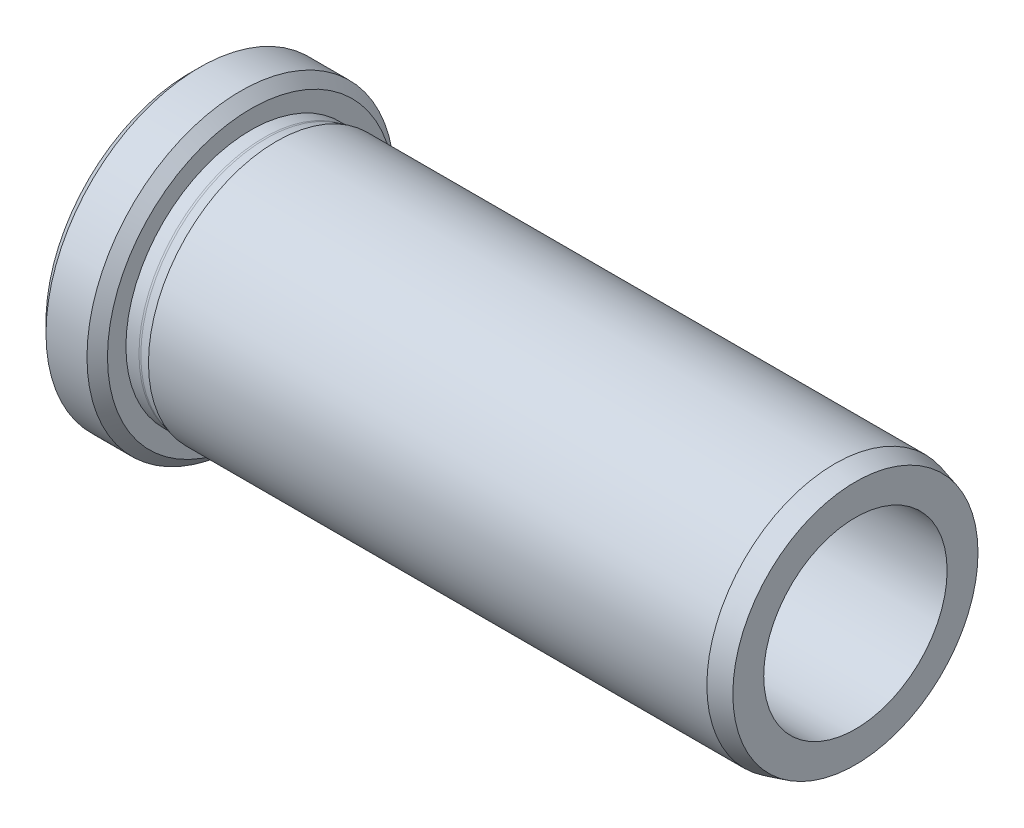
ISO-10303-21;
HEADER;
FILE_DESCRIPTION(('STEP AP214'),'2;1');
FILE_NAME('part.step','',(''),(''),'','','');
FILE_SCHEMA(('AUTOMOTIVE_DESIGN { 1 0 10303 214 1 1 1 1 }'));
ENDSEC;
DATA;
#1=APPLICATION_CONTEXT('core data for automotive mechanical design processes');
#2=APPLICATION_PROTOCOL_DEFINITION('international standard','automotive_design',2000,#1);
#3=PRODUCT_CONTEXT('',#1,'mechanical');
#4=PRODUCT('Part','Part','',(#3));
#5=PRODUCT_RELATED_PRODUCT_CATEGORY('part','',(#4));
#6=PRODUCT_DEFINITION_FORMATION('','',#4);
#7=PRODUCT_DEFINITION_CONTEXT('part definition',#1,'design');
#8=PRODUCT_DEFINITION('design','',#6,#7);
#9=PRODUCT_DEFINITION_SHAPE('','',#8);
#10=(LENGTH_UNIT() NAMED_UNIT(*) SI_UNIT(.MILLI.,.METRE.));
#11=(NAMED_UNIT(*) PLANE_ANGLE_UNIT() SI_UNIT($,.RADIAN.));
#12=(NAMED_UNIT(*) SI_UNIT($,.STERADIAN.) SOLID_ANGLE_UNIT());
#13=UNCERTAINTY_MEASURE_WITH_UNIT(LENGTH_MEASURE(1.E-05),#10,'distance_accuracy_value','');
#14=(GEOMETRIC_REPRESENTATION_CONTEXT(3) GLOBAL_UNCERTAINTY_ASSIGNED_CONTEXT((#13)) GLOBAL_UNIT_ASSIGNED_CONTEXT((#10,
#11,#12)) REPRESENTATION_CONTEXT('',''));
#15=CARTESIAN_POINT('',(0.,0.,0.));
#16=DIRECTION('',(0.,0.,1.));
#17=DIRECTION('',(1.,0.,0.));
#18=AXIS2_PLACEMENT_3D('',#15,#16,#17);
#19=CARTESIAN_POINT('',(30.8004766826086,8.95,0.));
#20=DIRECTION('',(1.,0.,0.));
#21=DIRECTION('',(0.,0.,-1.));
#22=AXIS2_PLACEMENT_3D('',#19,#20,#21);
#23=PLANE('',#22);
#24=CARTESIAN_POINT('',(30.8004766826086,0.,0.));
#25=DIRECTION('',(-1.,0.,0.));
#26=DIRECTION('',(0.,0.,1.));
#27=AXIS2_PLACEMENT_3D('',#24,#25,#26);
#28=CIRCLE('',#27,8.95);
#29=CARTESIAN_POINT('',(30.8004766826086,0.,8.95));
#30=VERTEX_POINT('',#29);
#31=EDGE_CURVE('E64',#30,#30,#28,.T.);
#32=ORIENTED_EDGE('',*,*,#31,.F.);
#33=EDGE_LOOP('',(#32));
#34=FACE_BOUND('',#33,.T.);
#35=CARTESIAN_POINT('',(30.8004766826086,0.,0.));
#36=DIRECTION('',(-1.,0.,0.));
#37=DIRECTION('',(0.,0.,1.));
#38=AXIS2_PLACEMENT_3D('',#35,#36,#37);
#39=CIRCLE('',#38,9.);
#40=CARTESIAN_POINT('',(30.8004766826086,0.,9.));
#41=VERTEX_POINT('',#40);
#42=EDGE_CURVE('E40',#41,#41,#39,.T.);
#43=ORIENTED_EDGE('',*,*,#42,.T.);
#44=EDGE_LOOP('',(#43));
#45=FACE_BOUND('',#44,.T.);
#46=ADVANCED_FACE('F14',(#34,#45),#23,.F.);
#47=CARTESIAN_POINT('',(0.,0.,0.));
#48=DIRECTION('',(-1.,0.,0.));
#49=DIRECTION('',(0.,0.,1.));
#50=AXIS2_PLACEMENT_3D('',#47,#48,#49);
#51=CYLINDRICAL_SURFACE('',#50,9.);
#52=CARTESIAN_POINT('',(12.3004766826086,0.,0.));
#53=DIRECTION('',(1.,0.,0.));
#54=DIRECTION('',(0.,0.,-1.));
#55=AXIS2_PLACEMENT_3D('',#52,#53,#54);
#56=CIRCLE('',#55,9.);
#57=CARTESIAN_POINT('',(12.3004766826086,0.,-9.));
#58=VERTEX_POINT('',#57);
#59=EDGE_CURVE('E29',#58,#58,#56,.F.);
#60=ORIENTED_EDGE('',*,*,#59,.T.);
#61=EDGE_LOOP('',(#60));
#62=FACE_BOUND('',#61,.T.);
#63=ORIENTED_EDGE('',*,*,#42,.F.);
#64=EDGE_LOOP('',(#63));
#65=FACE_BOUND('',#64,.T.);
#66=ADVANCED_FACE('F72',(#62,#65),#51,.F.);
#67=CARTESIAN_POINT('',(10.8004766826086,15.,0.));
#68=DIRECTION('',(1.,0.,0.));
#69=DIRECTION('',(0.,0.,-1.));
#70=AXIS2_PLACEMENT_3D('',#67,#68,#69);
#71=PLANE('',#70);
#72=CARTESIAN_POINT('',(10.8004766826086,0.,0.));
#73=DIRECTION('',(1.,0.,0.));
#74=DIRECTION('',(0.,0.,-1.));
#75=AXIS2_PLACEMENT_3D('',#72,#73,#74);
#76=CIRCLE('',#75,10.5);
#77=CARTESIAN_POINT('',(10.8004766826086,0.,-10.5));
#78=VERTEX_POINT('',#77);
#79=EDGE_CURVE('E25',#78,#78,#76,.T.);
#80=ORIENTED_EDGE('',*,*,#79,.T.);
#81=EDGE_LOOP('',(#80));
#82=FACE_BOUND('',#81,.T.);
#83=CARTESIAN_POINT('',(10.8004766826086,0.,0.));
#84=DIRECTION('',(1.,0.,0.));
#85=DIRECTION('',(0.,0.,-1.));
#86=AXIS2_PLACEMENT_3D('',#83,#84,#85);
#87=CIRCLE('',#86,14.);
#88=CARTESIAN_POINT('',(10.8004766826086,0.,-14.));
#89=VERTEX_POINT('',#88);
#90=EDGE_CURVE('E37',#89,#89,#87,.F.);
#91=ORIENTED_EDGE('',*,*,#90,.T.);
#92=EDGE_LOOP('',(#91));
#93=FACE_BOUND('',#92,.T.);
#94=ADVANCED_FACE('F77',(#82,#93),#71,.F.);
#95=CARTESIAN_POINT('',(0.,0.,0.));
#96=DIRECTION('',(-1.,0.,0.));
#97=DIRECTION('',(0.,0.,1.));
#98=AXIS2_PLACEMENT_3D('',#95,#96,#97);
#99=CYLINDRICAL_SURFACE('',#98,15.);
#100=CARTESIAN_POINT('',(15.8004766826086,0.,0.));
#101=DIRECTION('',(-1.,0.,0.));
#102=DIRECTION('',(0.,0.,1.));
#103=AXIS2_PLACEMENT_3D('',#100,#101,#102);
#104=CIRCLE('',#103,15.);
#105=CARTESIAN_POINT('',(15.8004766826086,0.,15.));
#106=VERTEX_POINT('',#105);
#107=EDGE_CURVE('E21',#106,#106,#104,.T.);
#108=ORIENTED_EDGE('',*,*,#107,.T.);
#109=EDGE_LOOP('',(#108));
#110=FACE_BOUND('',#109,.T.);
#111=CARTESIAN_POINT('',(11.8004766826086,0.,0.));
#112=DIRECTION('',(1.,0.,0.));
#113=DIRECTION('',(0.,0.,-1.));
#114=AXIS2_PLACEMENT_3D('',#111,#112,#113);
#115=CIRCLE('',#114,15.);
#116=CARTESIAN_POINT('',(11.8004766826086,0.,-15.));
#117=VERTEX_POINT('',#116);
#118=EDGE_CURVE('E34',#117,#117,#115,.T.);
#119=ORIENTED_EDGE('',*,*,#118,.T.);
#120=EDGE_LOOP('',(#119));
#121=FACE_BOUND('',#120,.T.);
#122=ADVANCED_FACE('F85',(#110,#121),#99,.T.);
#123=CARTESIAN_POINT('',(16.8004766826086,15.,0.));
#124=DIRECTION('',(-1.,0.,0.));
#125=DIRECTION('',(0.,0.,1.));
#126=AXIS2_PLACEMENT_3D('',#123,#124,#125);
#127=PLANE('',#126);
#128=CARTESIAN_POINT('',(16.8004766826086,0.,0.));
#129=DIRECTION('',(-1.,0.,0.));
#130=DIRECTION('',(0.,0.,1.));
#131=AXIS2_PLACEMENT_3D('',#128,#129,#130);
#132=CIRCLE('',#131,14.);
#133=CARTESIAN_POINT('',(16.8004766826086,0.,14.));
#134=VERTEX_POINT('',#133);
#135=EDGE_CURVE('E9',#134,#134,#132,.F.);
#136=ORIENTED_EDGE('',*,*,#135,.T.);
#137=EDGE_LOOP('',(#136));
#138=FACE_BOUND('',#137,.T.);
#139=CARTESIAN_POINT('',(16.8004766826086,0.,0.));
#140=DIRECTION('',(-1.,0.,0.));
#141=DIRECTION('',(0.,0.,1.));
#142=AXIS2_PLACEMENT_3D('',#139,#140,#141);
#143=CIRCLE('',#142,12.2);
#144=CARTESIAN_POINT('',(16.8004766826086,0.,12.2));
#145=VERTEX_POINT('',#144);
#146=EDGE_CURVE('E43',#145,#145,#143,.T.);
#147=ORIENTED_EDGE('',*,*,#146,.T.);
#148=EDGE_LOOP('',(#147));
#149=FACE_BOUND('',#148,.T.);
#150=ADVANCED_FACE('F124',(#138,#149),#127,.F.);
#151=CARTESIAN_POINT('',(0.,0.,0.));
#152=DIRECTION('',(-1.,0.,0.));
#153=DIRECTION('',(0.,0.,1.));
#154=AXIS2_PLACEMENT_3D('',#151,#152,#153);
#155=CYLINDRICAL_SURFACE('',#154,12.2);
#156=ORIENTED_EDGE('',*,*,#146,.F.);
#157=EDGE_LOOP('',(#156));
#158=FACE_BOUND('',#157,.T.);
#159=CARTESIAN_POINT('',(18.075539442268,0.,0.));
#160=DIRECTION('',(-1.,0.,0.));
#161=DIRECTION('',(0.,0.,1.));
#162=AXIS2_PLACEMENT_3D('',#159,#160,#161);
#163=CIRCLE('',#162,12.2);
#164=CARTESIAN_POINT('',(18.075539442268,0.,12.2));
#165=VERTEX_POINT('',#164);
#166=EDGE_CURVE('E46',#165,#165,#163,.T.);
#167=ORIENTED_EDGE('',*,*,#166,.T.);
#168=EDGE_LOOP('',(#167));
#169=FACE_BOUND('',#168,.T.);
#170=ADVANCED_FACE('F129',(#158,#169),#155,.T.);
#171=CARTESIAN_POINT('',(18.075539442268,0.,0.));
#172=DIRECTION('',(-1.,0.,0.));
#173=DIRECTION('',(0.,0.,1.));
#174=AXIS2_PLACEMENT_3D('',#171,#172,#173);
#175=TOROIDAL_SURFACE('',#174,13.,0.8);
#176=ORIENTED_EDGE('',*,*,#166,.F.);
#177=EDGE_LOOP('',(#176));
#178=FACE_BOUND('',#177,.T.);
#179=CARTESIAN_POINT('',(18.28259467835,0.,0.));
#180=DIRECTION('',(-1.,0.,0.));
#181=DIRECTION('',(0.,0.,1.));
#182=AXIS2_PLACEMENT_3D('',#179,#180,#181);
#183=CIRCLE('',#182,12.2272593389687);
#184=CARTESIAN_POINT('',(18.28259467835,0.,12.2272593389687));
#185=VERTEX_POINT('',#184);
#186=EDGE_CURVE('E49',#185,#185,#183,.T.);
#187=ORIENTED_EDGE('',*,*,#186,.T.);
#188=EDGE_LOOP('',(#187));
#189=FACE_BOUND('',#188,.T.);
#190=ADVANCED_FACE('F189',(#178,#189),#175,.F.);
#191=CARTESIAN_POINT('',(19.3004766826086,0.,0.));
#192=DIRECTION('',(1.,0.,0.));
#193=DIRECTION('',(0.,0.,-1.));
#194=AXIS2_PLACEMENT_3D('',#191,#192,#193);
#195=CONICAL_SURFACE('',#194,12.5,0.261799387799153);
#196=ORIENTED_EDGE('',*,*,#186,.F.);
#197=EDGE_LOOP('',(#196));
#198=FACE_BOUND('',#197,.T.);
#199=CARTESIAN_POINT('',(19.3004766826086,0.,0.));
#200=DIRECTION('',(-1.,0.,0.));
#201=DIRECTION('',(0.,0.,1.));
#202=AXIS2_PLACEMENT_3D('',#199,#200,#201);
#203=CIRCLE('',#202,12.5);
#204=CARTESIAN_POINT('',(19.3004766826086,0.,12.5));
#205=VERTEX_POINT('',#204);
#206=EDGE_CURVE('E52',#205,#205,#203,.T.);
#207=ORIENTED_EDGE('',*,*,#206,.T.);
#208=EDGE_LOOP('',(#207));
#209=FACE_BOUND('',#208,.T.);
#210=ADVANCED_FACE('F179',(#198,#209),#195,.T.);
#211=CARTESIAN_POINT('',(0.,0.,0.));
#212=DIRECTION('',(-1.,0.,0.));
#213=DIRECTION('',(0.,0.,1.));
#214=AXIS2_PLACEMENT_3D('',#211,#212,#213);
#215=CYLINDRICAL_SURFACE('',#214,12.5);
#216=ORIENTED_EDGE('',*,*,#206,.F.);
#217=EDGE_LOOP('',(#216));
#218=FACE_BOUND('',#217,.T.);
#219=CARTESIAN_POINT('',(73.8004766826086,0.,0.));
#220=DIRECTION('',(-1.,0.,0.));
#221=DIRECTION('',(0.,0.,1.));
#222=AXIS2_PLACEMENT_3D('',#219,#220,#221);
#223=CIRCLE('',#222,12.5);
#224=CARTESIAN_POINT('',(73.8004766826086,0.,12.5));
#225=VERTEX_POINT('',#224);
#226=EDGE_CURVE('E55',#225,#225,#223,.T.);
#227=ORIENTED_EDGE('',*,*,#226,.T.);
#228=EDGE_LOOP('',(#227));
#229=FACE_BOUND('',#228,.T.);
#230=ADVANCED_FACE('F169',(#218,#229),#215,.T.);
#231=CARTESIAN_POINT('',(75.8004766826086,0.,0.));
#232=DIRECTION('',(-1.,0.,0.));
#233=DIRECTION('',(0.,0.,1.));
#234=AXIS2_PLACEMENT_3D('',#231,#232,#233);
#235=CONICAL_SURFACE('',#234,11.9641016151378,0.26179938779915);
#236=ORIENTED_EDGE('',*,*,#226,.F.);
#237=EDGE_LOOP('',(#236));
#238=FACE_BOUND('',#237,.T.);
#239=CARTESIAN_POINT('',(75.8004766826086,0.,0.));
#240=DIRECTION('',(-1.,0.,0.));
#241=DIRECTION('',(0.,0.,1.));
#242=AXIS2_PLACEMENT_3D('',#239,#240,#241);
#243=CIRCLE('',#242,11.9641016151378);
#244=CARTESIAN_POINT('',(75.8004766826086,0.,11.9641016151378));
#245=VERTEX_POINT('',#244);
#246=EDGE_CURVE('E58',#245,#245,#243,.T.);
#247=ORIENTED_EDGE('',*,*,#246,.T.);
#248=EDGE_LOOP('',(#247));
#249=FACE_BOUND('',#248,.T.);
#250=ADVANCED_FACE('F159',(#238,#249),#235,.T.);
#251=CARTESIAN_POINT('',(75.8004766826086,11.9641016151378,0.));
#252=DIRECTION('',(-1.,0.,0.));
#253=DIRECTION('',(0.,0.,1.));
#254=AXIS2_PLACEMENT_3D('',#251,#252,#253);
#255=PLANE('',#254);
#256=ORIENTED_EDGE('',*,*,#246,.F.);
#257=EDGE_LOOP('',(#256));
#258=FACE_BOUND('',#257,.T.);
#259=CARTESIAN_POINT('',(75.8004766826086,0.,0.));
#260=DIRECTION('',(-1.,0.,0.));
#261=DIRECTION('',(0.,0.,1.));
#262=AXIS2_PLACEMENT_3D('',#259,#260,#261);
#263=CIRCLE('',#262,8.95);
#264=CARTESIAN_POINT('',(75.8004766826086,0.,8.95));
#265=VERTEX_POINT('',#264);
#266=EDGE_CURVE('E61',#265,#265,#263,.T.);
#267=ORIENTED_EDGE('',*,*,#266,.T.);
#268=EDGE_LOOP('',(#267));
#269=FACE_BOUND('',#268,.T.);
#270=ADVANCED_FACE('F148',(#258,#269),#255,.F.);
#271=CARTESIAN_POINT('',(0.,0.,0.));
#272=DIRECTION('',(-1.,0.,0.));
#273=DIRECTION('',(0.,0.,1.));
#274=AXIS2_PLACEMENT_3D('',#271,#272,#273);
#275=CYLINDRICAL_SURFACE('',#274,8.95);
#276=ORIENTED_EDGE('',*,*,#266,.F.);
#277=EDGE_LOOP('',(#276));
#278=FACE_BOUND('',#277,.T.);
#279=ORIENTED_EDGE('',*,*,#31,.T.);
#280=EDGE_LOOP('',(#279));
#281=FACE_BOUND('',#280,.T.);
#282=ADVANCED_FACE('F68',(#278,#281),#275,.F.);
#283=CARTESIAN_POINT('',(10.8004766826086,0.,0.));
#284=DIRECTION('',(1.,0.,0.));
#285=DIRECTION('',(0.,0.,-1.));
#286=AXIS2_PLACEMENT_3D('',#283,#284,#285);
#287=CONICAL_SURFACE('',#286,14.,0.785398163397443);
#288=ORIENTED_EDGE('',*,*,#118,.F.);
#289=EDGE_LOOP('',(#288));
#290=FACE_BOUND('',#289,.T.);
#291=ORIENTED_EDGE('',*,*,#90,.F.);
#292=EDGE_LOOP('',(#291));
#293=FACE_BOUND('',#292,.T.);
#294=ADVANCED_FACE('F90',(#290,#293),#287,.T.);
#295=CARTESIAN_POINT('',(12.3004766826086,0.,0.));
#296=DIRECTION('',(1.,0.,0.));
#297=DIRECTION('',(0.,0.,-1.));
#298=AXIS2_PLACEMENT_3D('',#295,#296,#297);
#299=TOROIDAL_SURFACE('',#298,10.5,1.5);
#300=ORIENTED_EDGE('',*,*,#79,.F.);
#301=EDGE_LOOP('',(#300));
#302=FACE_BOUND('',#301,.T.);
#303=ORIENTED_EDGE('',*,*,#59,.F.);
#304=EDGE_LOOP('',(#303));
#305=FACE_BOUND('',#304,.T.);
#306=ADVANCED_FACE('F92',(#302,#305),#299,.T.);
#307=CARTESIAN_POINT('',(15.8004766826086,0.,0.));
#308=DIRECTION('',(-1.,0.,0.));
#309=DIRECTION('',(0.,0.,1.));
#310=AXIS2_PLACEMENT_3D('',#307,#308,#309);
#311=CONICAL_SURFACE('',#310,15.,0.785398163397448);
#312=ORIENTED_EDGE('',*,*,#135,.F.);
#313=EDGE_LOOP('',(#312));
#314=FACE_BOUND('',#313,.T.);
#315=ORIENTED_EDGE('',*,*,#107,.F.);
#316=EDGE_LOOP('',(#315));
#317=FACE_BOUND('',#316,.T.);
#318=ADVANCED_FACE('F16',(#314,#317),#311,.T.);
#319=CLOSED_SHELL('',(#46,#66,#94,#122,#150,#170,#190,#210,#230,#250,#270,#282,#294,#306,#318));
#320=MANIFOLD_SOLID_BREP('B1',#319);
#321=ADVANCED_BREP_SHAPE_REPRESENTATION('',(#18,#320),#14);
#322=SHAPE_DEFINITION_REPRESENTATION(#9,#321);
ENDSEC;
END-ISO-10303-21;
